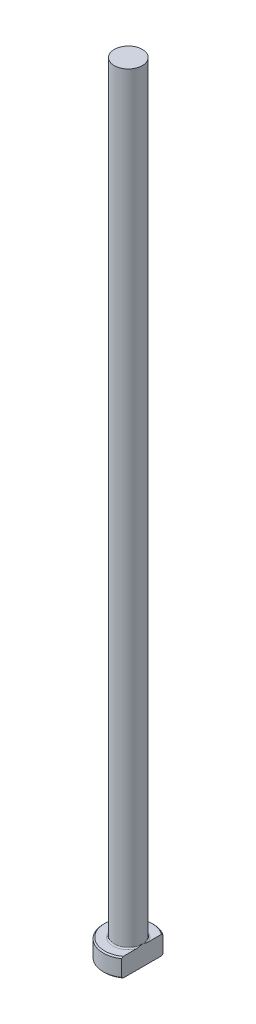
from build123d import *
from build123d.topology import SkipClean

# Parameters (mm, degrees)
CHAMFER1_SIZE = 0.2
FILLET1_R     = 0.2
KEY_DEPTH     = 126.127934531


with BuildPart() as part:
    # Sketch1 → Revolve1 (revolve)
    with BuildSketch(Plane.XY, mode=Mode.PRIVATE) as revolve1_sk:
        Polygon((0, 0), (-4, 0), (-4, 3), (-2.25, 3), (-2.25, 125), (0, 125), align=None)
    revolve(revolve1_sk.sketch.rotate(Axis((0, 259.958771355, 0), (0, -1, 0)), 270), axis=Axis((0, 259.958771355, 0), (0, -1, 0)))

    # Chamfer1
    chamfer1_edges = [part.edges().sort_by_distance(p)[0] for p in [
        (0, 3, -4),
        (0, 0, -4),
    ]]
    chamfer(chamfer1_edges, length=CHAMFER1_SIZE)

    # Fillet1
    fillet1_edges = [part.edges().sort_by_distance(p)[0] for p in [
        (0, 3, -2.25),
    ]]
    fillet(fillet1_edges, radius=FILLET1_R)

    # Sketch2 → KEY (cut, through all)
    with SkipClean():  # the faces are left unmerged after this step: merging them gives an invalid solid
        with BuildSketch(Plane(origin=(0, 0, 0), x_dir=(1, 0, 0), z_dir=(0, 1, 0))):
            with BuildLine():
                Line((2.25, 3.307189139), (2.25, -3.307189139))
                ThreePointArc((2.25, -3.307189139), (4, 0), (2.25, 3.307189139))
            make_face()
        extrude(amount=KEY_DEPTH, mode=Mode.SUBTRACT)


solid = part.part
